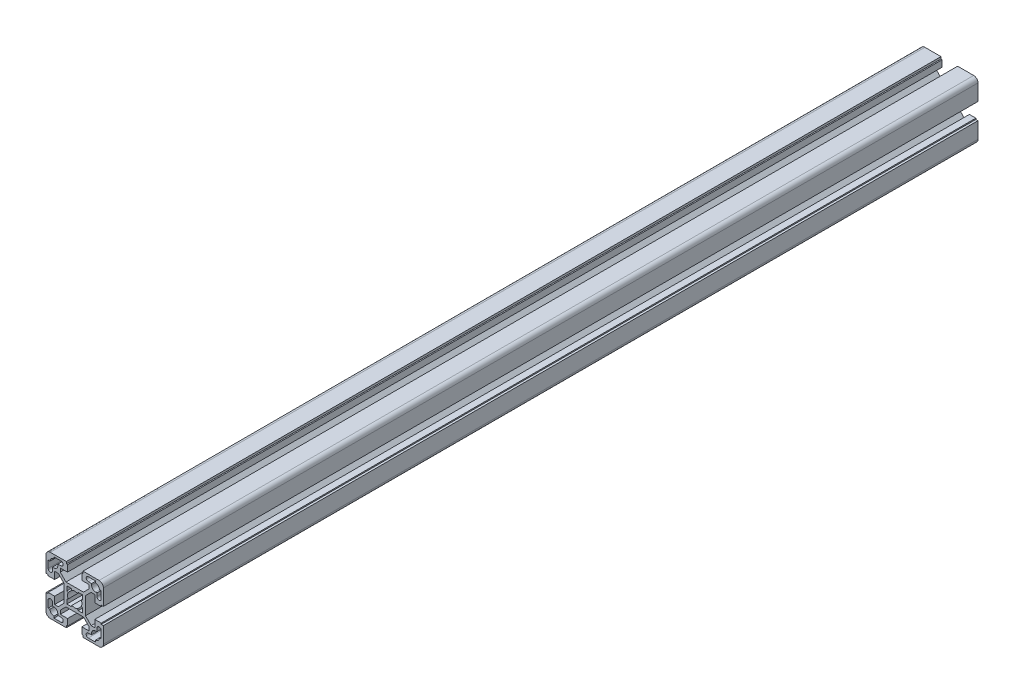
from build123d import *

# Parameters (mm, degrees)
BOSS_EXTRUDE1_DEPTH = 609.6


with BuildPart() as part:
    # Sketch1 → Boss-Extrude1 (new body)
    with BuildSketch(Plane.XY.offset(25)):
        with BuildLine():
            Line((10.05, -11.464213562), (10.05, -14))
            Line((10.05, -14), (5, -14))
            Line((5, -14), (5, -18.5))
            Line((5, -18.5), (5.8, -18.5))
            Line((5.8, -18.5), (5.8, -20))
            Line((5.8, -20), (17, -20))
            ThreePointArc((17, -20), (19.121320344, -19.121320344), (20, -17))
            Line((20, -17), (20, -5.8))
            Line((20, -5.8), (18.5, -5.8))
            Line((18.5, -5.8), (18.5, -5))
            Line((18.5, -5), (14, -5))
            Line((14, -5), (14, -10.05))
            Line((14, -10.05), (11.464213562, -10.05))
            Line((11.464213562, -10.05), (7.5, -6.085786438))
            Line((7.5, -6.085786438), (7.5, 6.085786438))
            Line((7.5, 6.085786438), (11.464213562, 10.05))
            Line((11.464213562, 10.05), (14, 10.05))
            Line((14, 10.05), (14, 5))
            Line((14, 5), (18.5, 5))
            Line((18.5, 5), (18.5, 5.8))
            Line((18.5, 5.8), (20, 5.8))
            Line((20, 5.8), (20, 17))
            ThreePointArc((20, 17), (19.121320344, 19.121320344), (17, 20))
            Line((17, 20), (5.8, 20))
            Line((5.8, 20), (5.8, 18.5))
            Line((5.8, 18.5), (5, 18.5))
            Line((5, 18.5), (5, 14))
            Line((5, 14), (10.05, 14))
            Line((10.05, 14), (10.05, 11.464213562))
            Line((10.05, 11.464213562), (6.085786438, 7.5))
            Line((6.085786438, 7.5), (-6.085786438, 7.5))
            Line((-6.085786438, 7.5), (-10.05, 11.464213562))
            Line((-10.05, 11.464213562), (-10.05, 14))
            Line((-10.05, 14), (-5, 14))
            Line((-5, 14), (-5, 18.5))
            Line((-5, 18.5), (-5.8, 18.5))
            Line((-5.8, 18.5), (-5.8, 20))
            Line((-5.8, 20), (-17, 20))
            ThreePointArc((-17, 20), (-19.121320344, 19.121320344), (-20, 17))
            Line((-20, 17), (-20, 5.8))
            Line((-20, 5.8), (-18.5, 5.8))
            Line((-18.5, 5.8), (-18.5, 5))
            Line((-18.5, 5), (-14, 5))
            Line((-14, 5), (-14, 10.05))
            Line((-14, 10.05), (-11.464213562, 10.05))
            Line((-11.464213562, 10.05), (-7.5, 6.085786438))
            Line((-7.5, 6.085786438), (-7.5, -6.085786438))
            Line((-7.5, -6.085786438), (-11.464213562, -10.05))
            Line((-11.464213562, -10.05), (-14, -10.05))
            Line((-14, -10.05), (-14, -5))
            Line((-14, -5), (-18.5, -5))
            Line((-18.5, -5), (-18.5, -5.8))
            Line((-18.5, -5.8), (-20, -5.8))
            Line((-20, -5.8), (-20, -17))
            ThreePointArc((-20, -17), (-19.121320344, -19.121320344), (-17, -20))
            Line((-17, -20), (-5.8, -20))
            Line((-5.8, -20), (-5.8, -18.5))
            Line((-5.8, -18.5), (-5, -18.5))
            Line((-5, -18.5), (-5, -14))
            Line((-5, -14), (-10.05, -14))
            Line((-10.05, -14), (-10.05, -11.464213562))
            Line((-10.05, -11.464213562), (-6.085786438, -7.5))
            Line((-6.085786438, -7.5), (6.085786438, -7.5))
            Line((6.085786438, -7.5), (10.05, -11.464213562))
        make_face()
        with BuildLine():
            Line((-17.25, -14.5), (-18.5, -14.5))
            Line((-18.5, -14.5), (-18.5, -9.5))
            ThreePointArc((-18.5, -9.5), (-17, -8), (-15.5, -9.5))
            Line((-15.5, -9.5), (-15.5, -11.75))
            Line((-15.5, -11.75), (-14.5, -11.75))
            ThreePointArc((-14.5, -11.75), (-12.555456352, -12.555456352), (-11.75, -14.5))
            Line((-11.75, -14.5), (-11.75, -15.5))
            Line((-11.75, -15.5), (-9.5, -15.5))
            ThreePointArc((-9.5, -15.5), (-8, -17), (-9.5, -18.5))
            Line((-9.5, -18.5), (-14.5, -18.5))
            Line((-14.5, -18.5), (-14.5, -17.25))
            ThreePointArc((-14.5, -17.25), (-16.444543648, -16.444543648), (-17.25, -14.5))
        make_face(mode=Mode.SUBTRACT)
        with BuildLine():
            Line((9.5, -15.5), (11.75, -15.5))
            Line((11.75, -15.5), (11.75, -14.5))
            ThreePointArc((11.75, -14.5), (12.555456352, -12.555456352), (14.5, -11.75))
            Line((14.5, -11.75), (15.5, -11.75))
            Line((15.5, -11.75), (15.5, -9.5))
            ThreePointArc((15.5, -9.5), (17, -8), (18.5, -9.5))
            Line((18.5, -9.5), (18.5, -14.5))
            Line((18.5, -14.5), (17.25, -14.5))
            ThreePointArc((17.25, -14.5), (16.444543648, -16.444543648), (14.5, -17.25))
            Line((14.5, -17.25), (14.5, -18.5))
            Line((14.5, -18.5), (9.5, -18.5))
            ThreePointArc((9.5, -18.5), (8, -17), (9.5, -15.5))
        make_face(mode=Mode.SUBTRACT)
        with BuildLine():
            Line((17.25, 14.5), (18.5, 14.5))
            Line((18.5, 14.5), (18.5, 9.5))
            ThreePointArc((18.5, 9.5), (17, 8), (15.5, 9.5))
            Line((15.5, 9.5), (15.5, 11.75))
            Line((15.5, 11.75), (14.5, 11.75))
            ThreePointArc((14.5, 11.75), (12.555456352, 12.555456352), (11.75, 14.5))
            Line((11.75, 14.5), (11.75, 15.5))
            Line((11.75, 15.5), (9.5, 15.5))
            ThreePointArc((9.5, 15.5), (8, 17), (9.5, 18.5))
            Line((9.5, 18.5), (14.5, 18.5))
            Line((14.5, 18.5), (14.5, 17.25))
            ThreePointArc((14.5, 17.25), (16.444543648, 16.444543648), (17.25, 14.5))
        make_face(mode=Mode.SUBTRACT)
        with BuildLine():
            Line((-9.5, 15.5), (-11.75, 15.5))
            Line((-11.75, 15.5), (-11.75, 14.5))
            ThreePointArc((-11.75, 14.5), (-12.555456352, 12.555456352), (-14.5, 11.75))
            Line((-14.5, 11.75), (-15.5, 11.75))
            Line((-15.5, 11.75), (-15.5, 9.5))
            ThreePointArc((-15.5, 9.5), (-17, 8), (-18.5, 9.5))
            Line((-18.5, 9.5), (-18.5, 14.5))
            Line((-18.5, 14.5), (-17.25, 14.5))
            ThreePointArc((-17.25, 14.5), (-16.444543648, 16.444543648), (-14.5, 17.25))
            Line((-14.5, 17.25), (-14.5, 18.5))
            Line((-14.5, 18.5), (-9.5, 18.5))
            ThreePointArc((-9.5, 18.5), (-8, 17), (-9.5, 15.5))
        make_face(mode=Mode.SUBTRACT)
        with BuildLine():
            Line((-2.397915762, -5.5), (-5.5, -5.5))
            Line((-5.5, -5.5), (-5.5, -2.397915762))
            Line((-5.5, -2.397915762), (-4.583333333, -1.998263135))
            ThreePointArc((-4.583333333, -1.998263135), (-5, 0), (-4.583333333, 1.998263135))
            Line((-4.583333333, 1.998263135), (-5.5, 2.397915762))
            Line((-5.5, 2.397915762), (-5.5, 5.5))
            Line((-5.5, 5.5), (-2.397915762, 5.5))
            Line((-2.397915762, 5.5), (-1.998263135, 4.583333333))
            ThreePointArc((-1.998263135, 4.583333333), (0, 5), (1.998263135, 4.583333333))
            Line((1.998263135, 4.583333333), (2.397915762, 5.5))
            Line((2.397915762, 5.5), (5.5, 5.5))
            Line((5.5, 5.5), (5.5, 2.397915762))
            Line((5.5, 2.397915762), (4.583333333, 1.998263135))
            ThreePointArc((4.583333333, 1.998263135), (5, 0), (4.583333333, -1.998263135))
            Line((4.583333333, -1.998263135), (5.5, -2.397915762))
            Line((5.5, -2.397915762), (5.5, -5.5))
            Line((5.5, -5.5), (2.397915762, -5.5))
            Line((2.397915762, -5.5), (1.998263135, -4.583333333))
            ThreePointArc((1.998263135, -4.583333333), (0, -5), (-1.998263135, -4.583333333))
            Line((-1.998263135, -4.583333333), (-2.397915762, -5.5))
        make_face(mode=Mode.SUBTRACT)
    extrude(amount=-BOSS_EXTRUDE1_DEPTH)


solid = part.part
